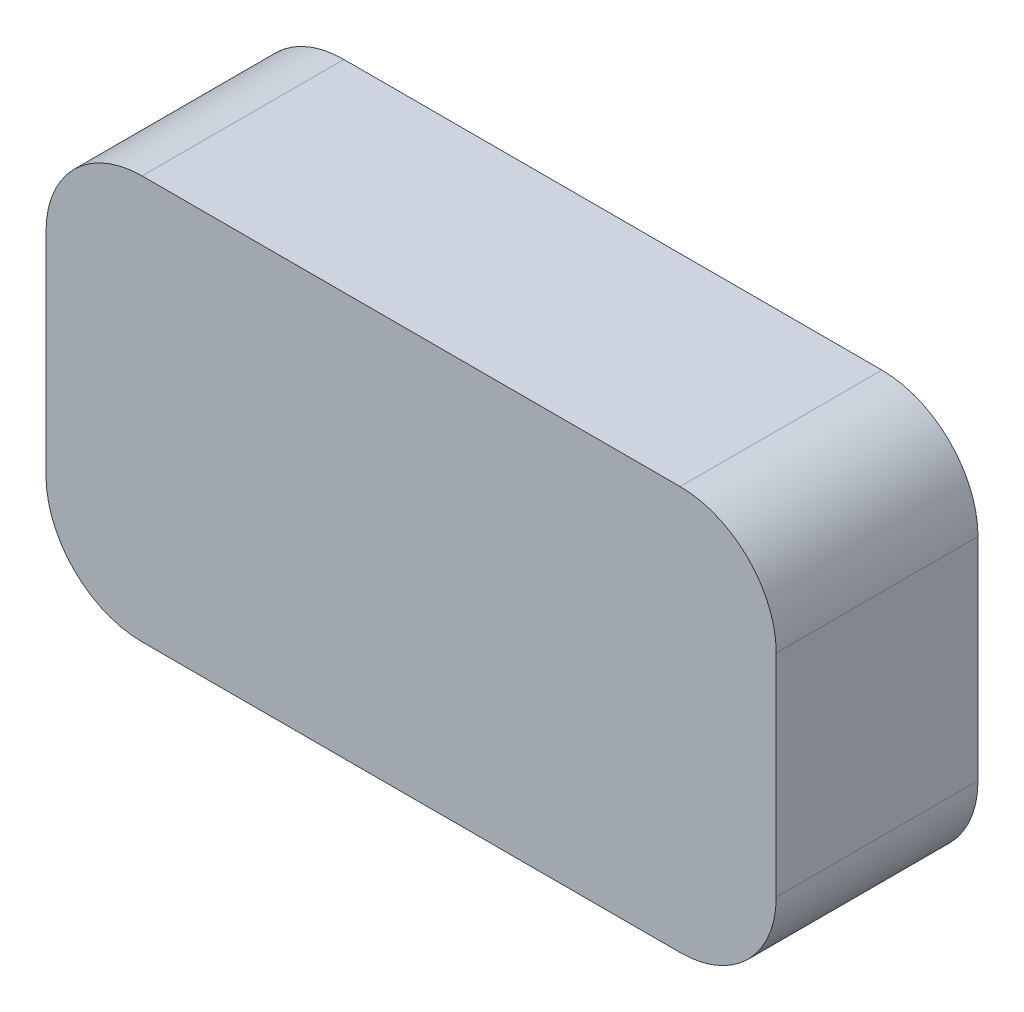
ISO-10303-21;
HEADER;
FILE_DESCRIPTION(('STEP AP214'),'2;1');
FILE_NAME('part.step','',(''),(''),'','','');
FILE_SCHEMA(('AUTOMOTIVE_DESIGN { 1 0 10303 214 1 1 1 1 }'));
ENDSEC;
DATA;
#1=APPLICATION_CONTEXT('core data for automotive mechanical design processes');
#2=APPLICATION_PROTOCOL_DEFINITION('international standard','automotive_design',2000,#1);
#3=PRODUCT_CONTEXT('',#1,'mechanical');
#4=PRODUCT('Part','Part','',(#3));
#5=PRODUCT_RELATED_PRODUCT_CATEGORY('part','',(#4));
#6=PRODUCT_DEFINITION_FORMATION('','',#4);
#7=PRODUCT_DEFINITION_CONTEXT('part definition',#1,'design');
#8=PRODUCT_DEFINITION('design','',#6,#7);
#9=PRODUCT_DEFINITION_SHAPE('','',#8);
#10=(LENGTH_UNIT() NAMED_UNIT(*) SI_UNIT(.MILLI.,.METRE.));
#11=(NAMED_UNIT(*) PLANE_ANGLE_UNIT() SI_UNIT($,.RADIAN.));
#12=(NAMED_UNIT(*) SI_UNIT($,.STERADIAN.) SOLID_ANGLE_UNIT());
#13=UNCERTAINTY_MEASURE_WITH_UNIT(LENGTH_MEASURE(1.E-05),#10,'distance_accuracy_value','');
#14=(GEOMETRIC_REPRESENTATION_CONTEXT(3) GLOBAL_UNCERTAINTY_ASSIGNED_CONTEXT((#13)) GLOBAL_UNIT_ASSIGNED_CONTEXT((#10,
#11,#12)) REPRESENTATION_CONTEXT('',''));
#15=CARTESIAN_POINT('',(0.,0.,0.));
#16=DIRECTION('',(0.,0.,1.));
#17=DIRECTION('',(1.,0.,0.));
#18=AXIS2_PLACEMENT_3D('',#15,#16,#17);
#19=CARTESIAN_POINT('',(140.,65.,3.));
#20=DIRECTION('',(0.,0.,-1.));
#21=DIRECTION('',(-1.,0.,0.));
#22=AXIS2_PLACEMENT_3D('',#19,#20,#21);
#23=CYLINDRICAL_SURFACE('',#22,50.);
#24=CARTESIAN_POINT('',(140.,65.,0.));
#25=DIRECTION('',(0.,0.,1.));
#26=DIRECTION('',(1.,0.,0.));
#27=AXIS2_PLACEMENT_3D('',#24,#25,#26);
#28=CIRCLE('',#27,50.);
#29=CARTESIAN_POINT('',(190.,65.,0.));
#30=VERTEX_POINT('',#29);
#31=CARTESIAN_POINT('',(140.,115.,0.));
#32=VERTEX_POINT('',#31);
#33=EDGE_CURVE('E150',#30,#32,#28,.T.);
#34=ORIENTED_EDGE('',*,*,#33,.T.);
#35=DIRECTION('',(0.,0.,-1.));
#36=VECTOR('',#35,1.);
#37=CARTESIAN_POINT('',(140.,115.,3.));
#38=LINE('',#37,#36);
#39=CARTESIAN_POINT('',(140.,115.,105.));
#40=VERTEX_POINT('',#39);
#41=EDGE_CURVE('E11',#40,#32,#38,.T.);
#42=ORIENTED_EDGE('',*,*,#41,.F.);
#43=CARTESIAN_POINT('',(140.,65.,105.));
#44=DIRECTION('',(0.,0.,1.));
#45=DIRECTION('',(1.,0.,0.));
#46=AXIS2_PLACEMENT_3D('',#43,#44,#45);
#47=CIRCLE('',#46,50.);
#48=CARTESIAN_POINT('',(190.,65.,105.));
#49=VERTEX_POINT('',#48);
#50=EDGE_CURVE('E148',#49,#40,#47,.T.);
#51=ORIENTED_EDGE('',*,*,#50,.F.);
#52=DIRECTION('',(0.,0.,-1.));
#53=VECTOR('',#52,1.);
#54=CARTESIAN_POINT('',(190.,65.,3.));
#55=LINE('',#54,#53);
#56=EDGE_CURVE('E257',#49,#30,#55,.T.);
#57=ORIENTED_EDGE('',*,*,#56,.T.);
#58=EDGE_LOOP('',(#34,#42,#51,#57));
#59=FACE_BOUND('',#58,.T.);
#60=ADVANCED_FACE('F34',(#59),#23,.T.);
#61=CARTESIAN_POINT('',(140.,115.,3.));
#62=DIRECTION('',(0.,-1.,0.));
#63=DIRECTION('',(0.,0.,-1.));
#64=AXIS2_PLACEMENT_3D('',#61,#62,#63);
#65=PLANE('',#64);
#66=DIRECTION('',(-1.,0.,0.));
#67=VECTOR('',#66,1.);
#68=CARTESIAN_POINT('',(140.,115.,0.));
#69=LINE('',#68,#67);
#70=CARTESIAN_POINT('',(-140.,115.,0.));
#71=VERTEX_POINT('',#70);
#72=EDGE_CURVE('E243',#32,#71,#69,.T.);
#73=ORIENTED_EDGE('',*,*,#72,.T.);
#74=DIRECTION('',(0.,0.,-1.));
#75=VECTOR('',#74,1.);
#76=CARTESIAN_POINT('',(-140.,115.,3.));
#77=LINE('',#76,#75);
#78=CARTESIAN_POINT('',(-140.,115.,105.));
#79=VERTEX_POINT('',#78);
#80=EDGE_CURVE('E42',#79,#71,#77,.T.);
#81=ORIENTED_EDGE('',*,*,#80,.F.);
#82=DIRECTION('',(-1.,0.,0.));
#83=VECTOR('',#82,1.);
#84=CARTESIAN_POINT('',(140.,115.,105.));
#85=LINE('',#84,#83);
#86=EDGE_CURVE('E153',#40,#79,#85,.T.);
#87=ORIENTED_EDGE('',*,*,#86,.F.);
#88=ORIENTED_EDGE('',*,*,#41,.T.);
#89=EDGE_LOOP('',(#73,#81,#87,#88));
#90=FACE_BOUND('',#89,.T.);
#91=ADVANCED_FACE('F154',(#90),#65,.F.);
#92=CARTESIAN_POINT('',(-140.,65.,3.));
#93=DIRECTION('',(0.,0.,-1.));
#94=DIRECTION('',(-1.,0.,0.));
#95=AXIS2_PLACEMENT_3D('',#92,#93,#94);
#96=CYLINDRICAL_SURFACE('',#95,50.);
#97=CARTESIAN_POINT('',(-140.,65.,0.));
#98=DIRECTION('',(0.,0.,1.));
#99=DIRECTION('',(1.,0.,0.));
#100=AXIS2_PLACEMENT_3D('',#97,#98,#99);
#101=CIRCLE('',#100,50.);
#102=CARTESIAN_POINT('',(-190.,65.,0.));
#103=VERTEX_POINT('',#102);
#104=EDGE_CURVE('E245',#71,#103,#101,.T.);
#105=ORIENTED_EDGE('',*,*,#104,.T.);
#106=DIRECTION('',(0.,0.,-1.));
#107=VECTOR('',#106,1.);
#108=CARTESIAN_POINT('',(-190.,65.,3.));
#109=LINE('',#108,#107);
#110=CARTESIAN_POINT('',(-190.,65.,105.));
#111=VERTEX_POINT('',#110);
#112=EDGE_CURVE('E271',#111,#103,#109,.T.);
#113=ORIENTED_EDGE('',*,*,#112,.F.);
#114=CARTESIAN_POINT('',(-140.,65.,105.));
#115=DIRECTION('',(0.,0.,1.));
#116=DIRECTION('',(1.,0.,0.));
#117=AXIS2_PLACEMENT_3D('',#114,#115,#116);
#118=CIRCLE('',#117,50.);
#119=EDGE_CURVE('E159',#79,#111,#118,.T.);
#120=ORIENTED_EDGE('',*,*,#119,.F.);
#121=ORIENTED_EDGE('',*,*,#80,.T.);
#122=EDGE_LOOP('',(#105,#113,#120,#121));
#123=FACE_BOUND('',#122,.T.);
#124=ADVANCED_FACE('F275',(#123),#96,.T.);
#125=CARTESIAN_POINT('',(-190.,65.,3.));
#126=DIRECTION('',(1.,0.,0.));
#127=DIRECTION('',(0.,1.,0.));
#128=AXIS2_PLACEMENT_3D('',#125,#126,#127);
#129=PLANE('',#128);
#130=DIRECTION('',(0.,-1.,0.));
#131=VECTOR('',#130,1.);
#132=CARTESIAN_POINT('',(-190.,65.,0.));
#133=LINE('',#132,#131);
#134=CARTESIAN_POINT('',(-190.,-45.,0.));
#135=VERTEX_POINT('',#134);
#136=EDGE_CURVE('E247',#103,#135,#133,.T.);
#137=ORIENTED_EDGE('',*,*,#136,.T.);
#138=DIRECTION('',(0.,0.,-1.));
#139=VECTOR('',#138,1.);
#140=CARTESIAN_POINT('',(-190.,-45.,3.));
#141=LINE('',#140,#139);
#142=CARTESIAN_POINT('',(-190.,-45.,105.));
#143=VERTEX_POINT('',#142);
#144=EDGE_CURVE('E268',#143,#135,#141,.T.);
#145=ORIENTED_EDGE('',*,*,#144,.F.);
#146=DIRECTION('',(0.,-1.,0.));
#147=VECTOR('',#146,1.);
#148=CARTESIAN_POINT('',(-190.,65.,105.));
#149=LINE('',#148,#147);
#150=EDGE_CURVE('E169',#111,#143,#149,.T.);
#151=ORIENTED_EDGE('',*,*,#150,.F.);
#152=ORIENTED_EDGE('',*,*,#112,.T.);
#153=EDGE_LOOP('',(#137,#145,#151,#152));
#154=FACE_BOUND('',#153,.T.);
#155=ADVANCED_FACE('F282',(#154),#129,.F.);
#156=CARTESIAN_POINT('',(-140.,-45.,3.));
#157=DIRECTION('',(0.,0.,-1.));
#158=DIRECTION('',(-1.,0.,0.));
#159=AXIS2_PLACEMENT_3D('',#156,#157,#158);
#160=CYLINDRICAL_SURFACE('',#159,50.);
#161=CARTESIAN_POINT('',(-140.,-45.,0.));
#162=DIRECTION('',(0.,0.,1.));
#163=DIRECTION('',(1.,0.,0.));
#164=AXIS2_PLACEMENT_3D('',#161,#162,#163);
#165=CIRCLE('',#164,50.);
#166=CARTESIAN_POINT('',(-140.,-95.,0.));
#167=VERTEX_POINT('',#166);
#168=EDGE_CURVE('E249',#135,#167,#165,.T.);
#169=ORIENTED_EDGE('',*,*,#168,.T.);
#170=DIRECTION('',(0.,0.,-1.));
#171=VECTOR('',#170,1.);
#172=CARTESIAN_POINT('',(-140.,-95.,3.));
#173=LINE('',#172,#171);
#174=CARTESIAN_POINT('',(-140.,-95.,105.));
#175=VERTEX_POINT('',#174);
#176=EDGE_CURVE('E265',#175,#167,#173,.T.);
#177=ORIENTED_EDGE('',*,*,#176,.F.);
#178=CARTESIAN_POINT('',(-140.,-45.,105.));
#179=DIRECTION('',(0.,0.,1.));
#180=DIRECTION('',(1.,0.,0.));
#181=AXIS2_PLACEMENT_3D('',#178,#179,#180);
#182=CIRCLE('',#181,50.);
#183=EDGE_CURVE('E172',#143,#175,#182,.T.);
#184=ORIENTED_EDGE('',*,*,#183,.F.);
#185=ORIENTED_EDGE('',*,*,#144,.T.);
#186=EDGE_LOOP('',(#169,#177,#184,#185));
#187=FACE_BOUND('',#186,.T.);
#188=ADVANCED_FACE('F286',(#187),#160,.T.);
#189=CARTESIAN_POINT('',(-140.,-95.,3.));
#190=DIRECTION('',(0.,1.,0.));
#191=DIRECTION('',(0.,0.,1.));
#192=AXIS2_PLACEMENT_3D('',#189,#190,#191);
#193=PLANE('',#192);
#194=DIRECTION('',(1.,0.,0.));
#195=VECTOR('',#194,1.);
#196=CARTESIAN_POINT('',(-140.,-95.,0.));
#197=LINE('',#196,#195);
#198=CARTESIAN_POINT('',(140.,-95.,0.));
#199=VERTEX_POINT('',#198);
#200=EDGE_CURVE('E251',#167,#199,#197,.T.);
#201=ORIENTED_EDGE('',*,*,#200,.T.);
#202=DIRECTION('',(0.,0.,-1.));
#203=VECTOR('',#202,1.);
#204=CARTESIAN_POINT('',(140.,-95.,3.));
#205=LINE('',#204,#203);
#206=CARTESIAN_POINT('',(140.,-95.,105.));
#207=VERTEX_POINT('',#206);
#208=EDGE_CURVE('E262',#207,#199,#205,.T.);
#209=ORIENTED_EDGE('',*,*,#208,.F.);
#210=DIRECTION('',(1.,0.,0.));
#211=VECTOR('',#210,1.);
#212=CARTESIAN_POINT('',(-140.,-95.,105.));
#213=LINE('',#212,#211);
#214=EDGE_CURVE('E175',#175,#207,#213,.T.);
#215=ORIENTED_EDGE('',*,*,#214,.F.);
#216=ORIENTED_EDGE('',*,*,#176,.T.);
#217=EDGE_LOOP('',(#201,#209,#215,#216));
#218=FACE_BOUND('',#217,.T.);
#219=ADVANCED_FACE('F290',(#218),#193,.F.);
#220=CARTESIAN_POINT('',(140.,-45.,3.));
#221=DIRECTION('',(0.,0.,-1.));
#222=DIRECTION('',(-1.,0.,0.));
#223=AXIS2_PLACEMENT_3D('',#220,#221,#222);
#224=CYLINDRICAL_SURFACE('',#223,50.);
#225=CARTESIAN_POINT('',(140.,-45.,0.));
#226=DIRECTION('',(0.,0.,1.));
#227=DIRECTION('',(1.,0.,0.));
#228=AXIS2_PLACEMENT_3D('',#225,#226,#227);
#229=CIRCLE('',#228,50.);
#230=CARTESIAN_POINT('',(190.,-45.,0.));
#231=VERTEX_POINT('',#230);
#232=EDGE_CURVE('E253',#199,#231,#229,.T.);
#233=ORIENTED_EDGE('',*,*,#232,.T.);
#234=DIRECTION('',(0.,0.,-1.));
#235=VECTOR('',#234,1.);
#236=CARTESIAN_POINT('',(190.,-45.,3.));
#237=LINE('',#236,#235);
#238=CARTESIAN_POINT('',(190.,-45.,105.));
#239=VERTEX_POINT('',#238);
#240=EDGE_CURVE('E259',#239,#231,#237,.T.);
#241=ORIENTED_EDGE('',*,*,#240,.F.);
#242=CARTESIAN_POINT('',(140.,-45.,105.));
#243=DIRECTION('',(0.,0.,1.));
#244=DIRECTION('',(1.,0.,0.));
#245=AXIS2_PLACEMENT_3D('',#242,#243,#244);
#246=CIRCLE('',#245,50.);
#247=EDGE_CURVE('E178',#207,#239,#246,.T.);
#248=ORIENTED_EDGE('',*,*,#247,.F.);
#249=ORIENTED_EDGE('',*,*,#208,.T.);
#250=EDGE_LOOP('',(#233,#241,#248,#249));
#251=FACE_BOUND('',#250,.T.);
#252=ADVANCED_FACE('F293',(#251),#224,.T.);
#253=CARTESIAN_POINT('',(190.,-45.,3.));
#254=DIRECTION('',(-1.,0.,0.));
#255=DIRECTION('',(0.,-1.,0.));
#256=AXIS2_PLACEMENT_3D('',#253,#254,#255);
#257=PLANE('',#256);
#258=DIRECTION('',(0.,1.,0.));
#259=VECTOR('',#258,1.);
#260=CARTESIAN_POINT('',(190.,-45.,0.));
#261=LINE('',#260,#259);
#262=EDGE_CURVE('E255',#231,#30,#261,.T.);
#263=ORIENTED_EDGE('',*,*,#262,.T.);
#264=ORIENTED_EDGE('',*,*,#56,.F.);
#265=DIRECTION('',(0.,1.,0.));
#266=VECTOR('',#265,1.);
#267=CARTESIAN_POINT('',(190.,-45.,105.));
#268=LINE('',#267,#266);
#269=EDGE_CURVE('E165',#239,#49,#268,.T.);
#270=ORIENTED_EDGE('',*,*,#269,.F.);
#271=ORIENTED_EDGE('',*,*,#240,.T.);
#272=EDGE_LOOP('',(#263,#264,#270,#271));
#273=FACE_BOUND('',#272,.T.);
#274=ADVANCED_FACE('F296',(#273),#257,.F.);
#275=CARTESIAN_POINT('',(140.,65.,0.));
#276=DIRECTION('',(0.,0.,1.));
#277=DIRECTION('',(1.,0.,0.));
#278=AXIS2_PLACEMENT_3D('',#275,#276,#277);
#279=PLANE('',#278);
#280=ORIENTED_EDGE('',*,*,#33,.F.);
#281=ORIENTED_EDGE('',*,*,#262,.F.);
#282=ORIENTED_EDGE('',*,*,#232,.F.);
#283=ORIENTED_EDGE('',*,*,#200,.F.);
#284=ORIENTED_EDGE('',*,*,#168,.F.);
#285=ORIENTED_EDGE('',*,*,#136,.F.);
#286=ORIENTED_EDGE('',*,*,#104,.F.);
#287=ORIENTED_EDGE('',*,*,#72,.F.);
#288=EDGE_LOOP('',(#280,#281,#282,#283,#284,#285,#286,#287));
#289=FACE_BOUND('',#288,.T.);
#290=ADVANCED_FACE('F278',(#289),#279,.F.);
#291=CARTESIAN_POINT('',(140.,65.,105.));
#292=DIRECTION('',(0.,0.,1.));
#293=DIRECTION('',(1.,0.,0.));
#294=AXIS2_PLACEMENT_3D('',#291,#292,#293);
#295=PLANE('',#294);
#296=ORIENTED_EDGE('',*,*,#50,.T.);
#297=ORIENTED_EDGE('',*,*,#86,.T.);
#298=ORIENTED_EDGE('',*,*,#119,.T.);
#299=ORIENTED_EDGE('',*,*,#150,.T.);
#300=ORIENTED_EDGE('',*,*,#183,.T.);
#301=ORIENTED_EDGE('',*,*,#214,.T.);
#302=ORIENTED_EDGE('',*,*,#247,.T.);
#303=ORIENTED_EDGE('',*,*,#269,.T.);
#304=EDGE_LOOP('',(#296,#297,#298,#299,#300,#301,#302,#303));
#305=FACE_BOUND('',#304,.T.);
#306=ADVANCED_FACE('F162',(#305),#295,.T.);
#307=CLOSED_SHELL('',(#60,#91,#124,#155,#188,#219,#252,#274,#290,#306));
#308=CARTESIAN_POINT('',(140.,65.,3.));
#309=DIRECTION('',(0.,0.,1.));
#310=DIRECTION('',(1.,0.,0.));
#311=AXIS2_PLACEMENT_3D('',#308,#309,#310);
#312=PLANE('',#311);
#313=CARTESIAN_POINT('',(140.,65.,3.));
#314=DIRECTION('',(0.,0.,1.));
#315=DIRECTION('',(1.,0.,0.));
#316=AXIS2_PLACEMENT_3D('',#313,#314,#315);
#317=CIRCLE('',#316,48.);
#318=CARTESIAN_POINT('',(188.,65.,3.));
#319=VERTEX_POINT('',#318);
#320=CARTESIAN_POINT('',(140.,113.,3.));
#321=VERTEX_POINT('',#320);
#322=EDGE_CURVE('E49',#319,#321,#317,.T.);
#323=ORIENTED_EDGE('',*,*,#322,.T.);
#324=DIRECTION('',(-1.,0.,0.));
#325=VECTOR('',#324,1.);
#326=CARTESIAN_POINT('',(140.,113.,3.));
#327=LINE('',#326,#325);
#328=CARTESIAN_POINT('',(-140.,113.,3.));
#329=VERTEX_POINT('',#328);
#330=EDGE_CURVE('E53',#321,#329,#327,.T.);
#331=ORIENTED_EDGE('',*,*,#330,.T.);
#332=CARTESIAN_POINT('',(-140.,65.,3.));
#333=DIRECTION('',(0.,0.,1.));
#334=DIRECTION('',(1.,0.,0.));
#335=AXIS2_PLACEMENT_3D('',#332,#333,#334);
#336=CIRCLE('',#335,48.);
#337=CARTESIAN_POINT('',(-188.,65.,3.));
#338=VERTEX_POINT('',#337);
#339=EDGE_CURVE('E209',#329,#338,#336,.T.);
#340=ORIENTED_EDGE('',*,*,#339,.T.);
#341=DIRECTION('',(0.,-1.,0.));
#342=VECTOR('',#341,1.);
#343=CARTESIAN_POINT('',(-188.,65.,3.));
#344=LINE('',#343,#342);
#345=CARTESIAN_POINT('',(-188.,-45.,3.));
#346=VERTEX_POINT('',#345);
#347=EDGE_CURVE('E211',#338,#346,#344,.T.);
#348=ORIENTED_EDGE('',*,*,#347,.T.);
#349=CARTESIAN_POINT('',(-140.,-45.,3.));
#350=DIRECTION('',(0.,0.,1.));
#351=DIRECTION('',(1.,0.,0.));
#352=AXIS2_PLACEMENT_3D('',#349,#350,#351);
#353=CIRCLE('',#352,48.0000000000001);
#354=CARTESIAN_POINT('',(-140.,-93.,3.));
#355=VERTEX_POINT('',#354);
#356=EDGE_CURVE('E213',#346,#355,#353,.T.);
#357=ORIENTED_EDGE('',*,*,#356,.T.);
#358=DIRECTION('',(1.,0.,0.));
#359=VECTOR('',#358,1.);
#360=CARTESIAN_POINT('',(-140.,-93.,3.));
#361=LINE('',#360,#359);
#362=CARTESIAN_POINT('',(140.,-93.,3.));
#363=VERTEX_POINT('',#362);
#364=EDGE_CURVE('E215',#355,#363,#361,.T.);
#365=ORIENTED_EDGE('',*,*,#364,.T.);
#366=CARTESIAN_POINT('',(140.,-45.,3.));
#367=DIRECTION('',(0.,0.,1.));
#368=DIRECTION('',(1.,0.,0.));
#369=AXIS2_PLACEMENT_3D('',#366,#367,#368);
#370=CIRCLE('',#369,48.);
#371=CARTESIAN_POINT('',(188.,-45.,3.));
#372=VERTEX_POINT('',#371);
#373=EDGE_CURVE('E217',#363,#372,#370,.T.);
#374=ORIENTED_EDGE('',*,*,#373,.T.);
#375=DIRECTION('',(0.,1.,0.));
#376=VECTOR('',#375,1.);
#377=CARTESIAN_POINT('',(188.,-45.,3.));
#378=LINE('',#377,#376);
#379=EDGE_CURVE('E185',#372,#319,#378,.T.);
#380=ORIENTED_EDGE('',*,*,#379,.T.);
#381=EDGE_LOOP('',(#323,#331,#340,#348,#357,#365,#374,#380));
#382=FACE_BOUND('',#381,.T.);
#383=ADVANCED_FACE('F354',(#382),#312,.T.);
#384=CARTESIAN_POINT('',(-140.,65.,103.));
#385=DIRECTION('',(0.,0.,-1.));
#386=DIRECTION('',(-1.,0.,0.));
#387=AXIS2_PLACEMENT_3D('',#384,#385,#386);
#388=CYLINDRICAL_SURFACE('',#387,48.);
#389=ORIENTED_EDGE('',*,*,#339,.F.);
#390=DIRECTION('',(0.,0.,-1.));
#391=VECTOR('',#390,1.);
#392=CARTESIAN_POINT('',(-140.,113.,103.));
#393=LINE('',#392,#391);
#394=CARTESIAN_POINT('',(-140.,113.,103.));
#395=VERTEX_POINT('',#394);
#396=EDGE_CURVE('E237',#395,#329,#393,.T.);
#397=ORIENTED_EDGE('',*,*,#396,.F.);
#398=CARTESIAN_POINT('',(-140.,65.,103.));
#399=DIRECTION('',(0.,0.,1.));
#400=DIRECTION('',(1.,0.,0.));
#401=AXIS2_PLACEMENT_3D('',#398,#399,#400);
#402=CIRCLE('',#401,48.);
#403=CARTESIAN_POINT('',(-188.,65.,103.));
#404=VERTEX_POINT('',#403);
#405=EDGE_CURVE('E188',#395,#404,#402,.T.);
#406=ORIENTED_EDGE('',*,*,#405,.T.);
#407=DIRECTION('',(0.,0.,-1.));
#408=VECTOR('',#407,1.);
#409=CARTESIAN_POINT('',(-188.,65.,103.));
#410=LINE('',#409,#408);
#411=EDGE_CURVE('E234',#404,#338,#410,.T.);
#412=ORIENTED_EDGE('',*,*,#411,.T.);
#413=EDGE_LOOP('',(#389,#397,#406,#412));
#414=FACE_BOUND('',#413,.T.);
#415=ADVANCED_FACE('F348',(#414),#388,.F.);
#416=CARTESIAN_POINT('',(-188.,65.,103.));
#417=DIRECTION('',(1.,0.,0.));
#418=DIRECTION('',(0.,0.,-1.));
#419=AXIS2_PLACEMENT_3D('',#416,#417,#418);
#420=PLANE('',#419);
#421=ORIENTED_EDGE('',*,*,#347,.F.);
#422=ORIENTED_EDGE('',*,*,#411,.F.);
#423=DIRECTION('',(0.,-1.,0.));
#424=VECTOR('',#423,1.);
#425=CARTESIAN_POINT('',(-188.,65.,103.));
#426=LINE('',#425,#424);
#427=CARTESIAN_POINT('',(-188.,-45.,103.));
#428=VERTEX_POINT('',#427);
#429=EDGE_CURVE('E191',#404,#428,#426,.T.);
#430=ORIENTED_EDGE('',*,*,#429,.T.);
#431=DIRECTION('',(0.,0.,-1.));
#432=VECTOR('',#431,1.);
#433=CARTESIAN_POINT('',(-188.,-45.,103.));
#434=LINE('',#433,#432);
#435=EDGE_CURVE('E231',#428,#346,#434,.T.);
#436=ORIENTED_EDGE('',*,*,#435,.T.);
#437=EDGE_LOOP('',(#421,#422,#430,#436));
#438=FACE_BOUND('',#437,.T.);
#439=ADVANCED_FACE('F353',(#438),#420,.T.);
#440=CARTESIAN_POINT('',(-140.,-45.,103.));
#441=DIRECTION('',(0.,0.,-1.));
#442=DIRECTION('',(-1.,0.,0.));
#443=AXIS2_PLACEMENT_3D('',#440,#441,#442);
#444=CYLINDRICAL_SURFACE('',#443,48.0000000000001);
#445=ORIENTED_EDGE('',*,*,#356,.F.);
#446=ORIENTED_EDGE('',*,*,#435,.F.);
#447=CARTESIAN_POINT('',(-140.,-45.,103.));
#448=DIRECTION('',(0.,0.,1.));
#449=DIRECTION('',(1.,0.,0.));
#450=AXIS2_PLACEMENT_3D('',#447,#448,#449);
#451=CIRCLE('',#450,48.0000000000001);
#452=CARTESIAN_POINT('',(-140.,-93.,103.));
#453=VERTEX_POINT('',#452);
#454=EDGE_CURVE('E194',#428,#453,#451,.T.);
#455=ORIENTED_EDGE('',*,*,#454,.T.);
#456=DIRECTION('',(0.,0.,-1.));
#457=VECTOR('',#456,1.);
#458=CARTESIAN_POINT('',(-140.,-93.,103.));
#459=LINE('',#458,#457);
#460=EDGE_CURVE('E228',#453,#355,#459,.T.);
#461=ORIENTED_EDGE('',*,*,#460,.T.);
#462=EDGE_LOOP('',(#445,#446,#455,#461));
#463=FACE_BOUND('',#462,.T.);
#464=ADVANCED_FACE('F366',(#463),#444,.F.);
#465=CARTESIAN_POINT('',(-140.,-93.,103.));
#466=DIRECTION('',(0.,1.,0.));
#467=DIRECTION('',(0.,0.,1.));
#468=AXIS2_PLACEMENT_3D('',#465,#466,#467);
#469=PLANE('',#468);
#470=ORIENTED_EDGE('',*,*,#364,.F.);
#471=ORIENTED_EDGE('',*,*,#460,.F.);
#472=DIRECTION('',(1.,0.,0.));
#473=VECTOR('',#472,1.);
#474=CARTESIAN_POINT('',(-140.,-93.,103.));
#475=LINE('',#474,#473);
#476=CARTESIAN_POINT('',(140.,-93.,103.));
#477=VERTEX_POINT('',#476);
#478=EDGE_CURVE('E197',#453,#477,#475,.T.);
#479=ORIENTED_EDGE('',*,*,#478,.T.);
#480=DIRECTION('',(0.,0.,-1.));
#481=VECTOR('',#480,1.);
#482=CARTESIAN_POINT('',(140.,-93.,103.));
#483=LINE('',#482,#481);
#484=EDGE_CURVE('E225',#477,#363,#483,.T.);
#485=ORIENTED_EDGE('',*,*,#484,.T.);
#486=EDGE_LOOP('',(#470,#471,#479,#485));
#487=FACE_BOUND('',#486,.T.);
#488=ADVANCED_FACE('F376',(#487),#469,.T.);
#489=CARTESIAN_POINT('',(140.,-45.,103.));
#490=DIRECTION('',(0.,0.,-1.));
#491=DIRECTION('',(-1.,0.,0.));
#492=AXIS2_PLACEMENT_3D('',#489,#490,#491);
#493=CYLINDRICAL_SURFACE('',#492,48.);
#494=ORIENTED_EDGE('',*,*,#373,.F.);
#495=ORIENTED_EDGE('',*,*,#484,.F.);
#496=CARTESIAN_POINT('',(140.,-45.,103.));
#497=DIRECTION('',(0.,0.,1.));
#498=DIRECTION('',(1.,0.,0.));
#499=AXIS2_PLACEMENT_3D('',#496,#497,#498);
#500=CIRCLE('',#499,48.);
#501=CARTESIAN_POINT('',(188.,-45.,103.));
#502=VERTEX_POINT('',#501);
#503=EDGE_CURVE('E200',#477,#502,#500,.T.);
#504=ORIENTED_EDGE('',*,*,#503,.T.);
#505=DIRECTION('',(0.,0.,-1.));
#506=VECTOR('',#505,1.);
#507=CARTESIAN_POINT('',(188.,-45.,103.));
#508=LINE('',#507,#506);
#509=EDGE_CURVE('E222',#502,#372,#508,.T.);
#510=ORIENTED_EDGE('',*,*,#509,.T.);
#511=EDGE_LOOP('',(#494,#495,#504,#510));
#512=FACE_BOUND('',#511,.T.);
#513=ADVANCED_FACE('F386',(#512),#493,.F.);
#514=CARTESIAN_POINT('',(188.,-45.,103.));
#515=DIRECTION('',(-1.,0.,0.));
#516=DIRECTION('',(0.,0.,1.));
#517=AXIS2_PLACEMENT_3D('',#514,#515,#516);
#518=PLANE('',#517);
#519=ORIENTED_EDGE('',*,*,#379,.F.);
#520=ORIENTED_EDGE('',*,*,#509,.F.);
#521=DIRECTION('',(0.,1.,0.));
#522=VECTOR('',#521,1.);
#523=CARTESIAN_POINT('',(188.,-45.,103.));
#524=LINE('',#523,#522);
#525=CARTESIAN_POINT('',(188.,65.,103.));
#526=VERTEX_POINT('',#525);
#527=EDGE_CURVE('E203',#502,#526,#524,.T.);
#528=ORIENTED_EDGE('',*,*,#527,.T.);
#529=DIRECTION('',(0.,0.,-1.));
#530=VECTOR('',#529,1.);
#531=CARTESIAN_POINT('',(188.,65.,103.));
#532=LINE('',#531,#530);
#533=EDGE_CURVE('E206',#526,#319,#532,.T.);
#534=ORIENTED_EDGE('',*,*,#533,.T.);
#535=EDGE_LOOP('',(#519,#520,#528,#534));
#536=FACE_BOUND('',#535,.T.);
#537=ADVANCED_FACE('F396',(#536),#518,.T.);
#538=CARTESIAN_POINT('',(140.,65.,103.));
#539=DIRECTION('',(0.,0.,-1.));
#540=DIRECTION('',(-1.,0.,0.));
#541=AXIS2_PLACEMENT_3D('',#538,#539,#540);
#542=CYLINDRICAL_SURFACE('',#541,48.);
#543=ORIENTED_EDGE('',*,*,#322,.F.);
#544=ORIENTED_EDGE('',*,*,#533,.F.);
#545=CARTESIAN_POINT('',(140.,65.,103.));
#546=DIRECTION('',(0.,0.,1.));
#547=DIRECTION('',(1.,0.,0.));
#548=AXIS2_PLACEMENT_3D('',#545,#546,#547);
#549=CIRCLE('',#548,48.);
#550=CARTESIAN_POINT('',(140.,113.,103.));
#551=VERTEX_POINT('',#550);
#552=EDGE_CURVE('E181',#526,#551,#549,.T.);
#553=ORIENTED_EDGE('',*,*,#552,.T.);
#554=DIRECTION('',(0.,0.,-1.));
#555=VECTOR('',#554,1.);
#556=CARTESIAN_POINT('',(140.,113.,103.));
#557=LINE('',#556,#555);
#558=EDGE_CURVE('E239',#551,#321,#557,.T.);
#559=ORIENTED_EDGE('',*,*,#558,.T.);
#560=EDGE_LOOP('',(#543,#544,#553,#559));
#561=FACE_BOUND('',#560,.T.);
#562=ADVANCED_FACE('F406',(#561),#542,.F.);
#563=CARTESIAN_POINT('',(140.,113.,103.));
#564=DIRECTION('',(0.,-1.,0.));
#565=DIRECTION('',(0.,0.,-1.));
#566=AXIS2_PLACEMENT_3D('',#563,#564,#565);
#567=PLANE('',#566);
#568=ORIENTED_EDGE('',*,*,#330,.F.);
#569=ORIENTED_EDGE('',*,*,#558,.F.);
#570=DIRECTION('',(-1.,0.,0.));
#571=VECTOR('',#570,1.);
#572=CARTESIAN_POINT('',(140.,113.,103.));
#573=LINE('',#572,#571);
#574=EDGE_CURVE('E184',#551,#395,#573,.T.);
#575=ORIENTED_EDGE('',*,*,#574,.T.);
#576=ORIENTED_EDGE('',*,*,#396,.T.);
#577=EDGE_LOOP('',(#568,#569,#575,#576));
#578=FACE_BOUND('',#577,.T.);
#579=ADVANCED_FACE('F417',(#578),#567,.T.);
#580=CARTESIAN_POINT('',(140.,65.,103.));
#581=DIRECTION('',(0.,0.,1.));
#582=DIRECTION('',(1.,0.,0.));
#583=AXIS2_PLACEMENT_3D('',#580,#581,#582);
#584=PLANE('',#583);
#585=ORIENTED_EDGE('',*,*,#574,.F.);
#586=ORIENTED_EDGE('',*,*,#552,.F.);
#587=ORIENTED_EDGE('',*,*,#527,.F.);
#588=ORIENTED_EDGE('',*,*,#503,.F.);
#589=ORIENTED_EDGE('',*,*,#478,.F.);
#590=ORIENTED_EDGE('',*,*,#454,.F.);
#591=ORIENTED_EDGE('',*,*,#429,.F.);
#592=ORIENTED_EDGE('',*,*,#405,.F.);
#593=EDGE_LOOP('',(#585,#586,#587,#588,#589,#590,#591,#592));
#594=FACE_BOUND('',#593,.T.);
#595=ADVANCED_FACE('F426',(#594),#584,.F.);
#596=CLOSED_SHELL('',(#383,#415,#439,#464,#488,#513,#537,#562,#579,#595));
#597=ORIENTED_CLOSED_SHELL('',*,#596,.T.);
#598=BREP_WITH_VOIDS('B2',#307,(#597));
#599=ADVANCED_BREP_SHAPE_REPRESENTATION('',(#18,#598),#14);
#600=SHAPE_DEFINITION_REPRESENTATION(#9,#599);
ENDSEC;
END-ISO-10303-21;
